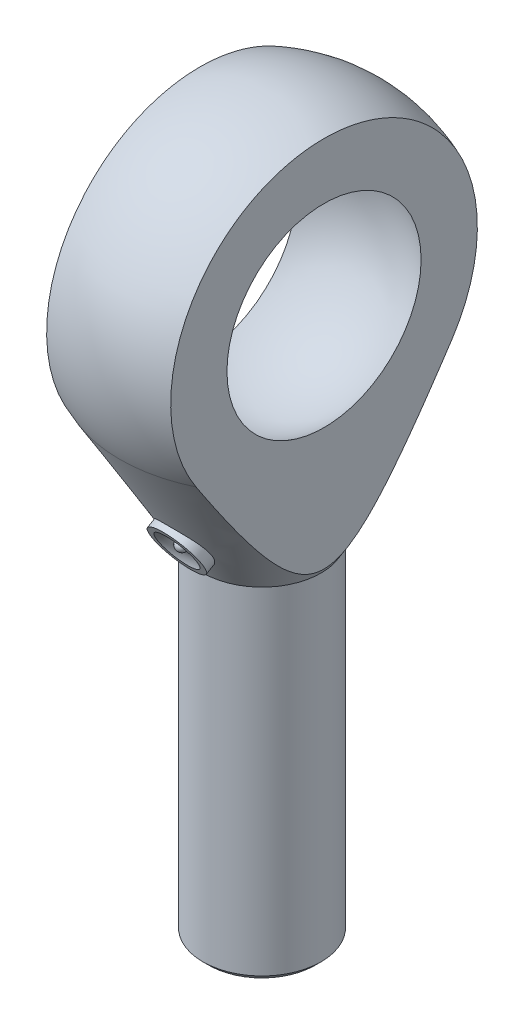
ISO-10303-21;
HEADER;
FILE_DESCRIPTION(('STEP AP214'),'2;1');
FILE_NAME('part.step','',(''),(''),'','','');
FILE_SCHEMA(('AUTOMOTIVE_DESIGN { 1 0 10303 214 1 1 1 1 }'));
ENDSEC;
DATA;
#1=APPLICATION_CONTEXT('core data for automotive mechanical design processes');
#2=APPLICATION_PROTOCOL_DEFINITION('international standard','automotive_design',2000,#1);
#3=PRODUCT_CONTEXT('',#1,'mechanical');
#4=PRODUCT('Part','Part','',(#3));
#5=PRODUCT_RELATED_PRODUCT_CATEGORY('part','',(#4));
#6=PRODUCT_DEFINITION_FORMATION('','',#4);
#7=PRODUCT_DEFINITION_CONTEXT('part definition',#1,'design');
#8=PRODUCT_DEFINITION('design','',#6,#7);
#9=PRODUCT_DEFINITION_SHAPE('','',#8);
#10=(LENGTH_UNIT() NAMED_UNIT(*) SI_UNIT(.MILLI.,.METRE.));
#11=(NAMED_UNIT(*) PLANE_ANGLE_UNIT() SI_UNIT($,.RADIAN.));
#12=(NAMED_UNIT(*) SI_UNIT($,.STERADIAN.) SOLID_ANGLE_UNIT());
#13=UNCERTAINTY_MEASURE_WITH_UNIT(LENGTH_MEASURE(1.E-05),#10,'distance_accuracy_value','');
#14=(GEOMETRIC_REPRESENTATION_CONTEXT(3) GLOBAL_UNCERTAINTY_ASSIGNED_CONTEXT((#13)) GLOBAL_UNIT_ASSIGNED_CONTEXT((#10,
#11,#12)) REPRESENTATION_CONTEXT('',''));
#15=CARTESIAN_POINT('',(0.,0.,0.));
#16=DIRECTION('',(0.,0.,1.));
#17=DIRECTION('',(1.,0.,0.));
#18=AXIS2_PLACEMENT_3D('',#15,#16,#17);
#19=CARTESIAN_POINT('',(0.,-19.,0.));
#20=DIRECTION('',(0.,1.,0.));
#21=DIRECTION('',(0.,0.,1.));
#22=AXIS2_PLACEMENT_3D('',#19,#20,#21);
#23=CONICAL_SURFACE('',#22,5.00000000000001,0.535846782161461);
#24=CARTESIAN_POINT('',(0.,-19.,0.));
#25=DIRECTION('',(0.,1.,0.));
#26=DIRECTION('',(0.,0.,1.));
#27=AXIS2_PLACEMENT_3D('',#24,#25,#26);
#28=CIRCLE('',#27,5.00000000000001);
#29=CARTESIAN_POINT('',(0.,-19.,5.00000000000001));
#30=VERTEX_POINT('',#29);
#31=EDGE_CURVE('E72',#30,#30,#28,.T.);
#32=ORIENTED_EDGE('',*,*,#31,.T.);
#33=EDGE_LOOP('',(#32));
#34=FACE_BOUND('',#33,.T.);
#35=CARTESIAN_POINT('',(0.,-7.14797043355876,0.));
#36=DIRECTION('',(0.,1.,0.));
#37=DIRECTION('',(0.,0.,1.));
#38=AXIS2_PLACEMENT_3D('',#35,#36,#37);
#39=CIRCLE('',#38,12.0377123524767);
#40=CARTESIAN_POINT('',(-5.25,-7.14797043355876,10.832544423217));
#41=VERTEX_POINT('',#40);
#42=CARTESIAN_POINT('',(5.25,-7.14797043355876,10.832544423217));
#43=VERTEX_POINT('',#42);
#44=EDGE_CURVE('E52',#41,#43,#39,.T.);
#45=ORIENTED_EDGE('',*,*,#44,.F.);
#46=CARTESIAN_POINT('',(-5.25,32.2330143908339,-35.03084662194));
#47=CARTESIAN_POINT('',(-5.25,30.5385005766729,-34.0133615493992));
#48=CARTESIAN_POINT('',(-5.25,28.8443748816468,-32.9952286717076));
#49=CARTESIAN_POINT('',(-5.25,25.4572376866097,-30.9570524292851));
#50=CARTESIAN_POINT('',(-5.25,23.7642262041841,-29.9370090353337));
#51=CARTESIAN_POINT('',(-5.25,20.3786557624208,-27.8937933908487));
#52=CARTESIAN_POINT('',(-5.25,18.6860977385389,-26.8706195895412));
#53=CARTESIAN_POINT('',(-5.25,15.3031192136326,-24.820793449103));
#54=CARTESIAN_POINT('',(-5.25,13.6126986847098,-23.7941411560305));
#55=CARTESIAN_POINT('',(-5.25,10.2741205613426,-21.7596857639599));
#56=CARTESIAN_POINT('',(-5.25,8.62589264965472,-20.7519982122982));
#57=CARTESIAN_POINT('',(-5.25,6.15690163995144,-19.2349364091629));
#58=CARTESIAN_POINT('',(-5.25,5.33444625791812,-18.7283169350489));
#59=CARTESIAN_POINT('',(-5.25,3.69098515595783,-17.7127347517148));
#60=CARTESIAN_POINT('',(-5.25,2.86997943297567,-17.2037720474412));
#61=CARTESIAN_POINT('',(-5.25,1.23011214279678,-16.1830028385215));
#62=CARTESIAN_POINT('',(-5.25,0.411249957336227,-15.6711973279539));
#63=CARTESIAN_POINT('',(-5.25,-1.22397392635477,-14.6436107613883));
#64=CARTESIAN_POINT('',(-5.25,-2.04033563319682,-14.1278297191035));
#65=CARTESIAN_POINT('',(-5.25,-3.66958599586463,-13.0909103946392));
#66=CARTESIAN_POINT('',(-5.25,-4.48247486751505,-12.5697724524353));
#67=CARTESIAN_POINT('',(-5.25,-5.69808971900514,-11.7823393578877));
#68=CARTESIAN_POINT('',(-5.25,-6.1026716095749,-11.5189094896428));
#69=CARTESIAN_POINT('',(-5.25,-6.91031133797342,-10.9897249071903));
#70=CARTESIAN_POINT('',(-5.25,-7.31336918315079,-10.7239702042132));
#71=CARTESIAN_POINT('',(-5.25,-7.96659191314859,-10.2899430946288));
#72=CARTESIAN_POINT('',(-5.25,-8.21733408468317,-10.1225394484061));
#73=CARTESIAN_POINT('',(-5.25,-8.71796428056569,-9.78645689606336));
#74=CARTESIAN_POINT('',(-5.25,-8.96785230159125,-9.61777798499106));
#75=CARTESIAN_POINT('',(-5.25,-9.46667439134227,-9.27892403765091));
#76=CARTESIAN_POINT('',(-5.25,-9.71560829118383,-9.10874875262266));
#77=CARTESIAN_POINT('',(-5.25,-10.2123031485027,-8.76669440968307));
#78=CARTESIAN_POINT('',(-5.25,-10.4600641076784,-8.59481535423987));
#79=CARTESIAN_POINT('',(-5.25,-10.9560877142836,-8.24773657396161));
#80=CARTESIAN_POINT('',(-5.25,-11.2043396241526,-8.07252148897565));
#81=CARTESIAN_POINT('',(-5.25,-11.699136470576,-7.71969734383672));
#82=CARTESIAN_POINT('',(-5.25,-11.945681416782,-7.54208829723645));
#83=CARTESIAN_POINT('',(-5.25,-12.4365851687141,-7.18408052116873));
#84=CARTESIAN_POINT('',(-5.25,-12.6809448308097,-7.00368296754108));
#85=CARTESIAN_POINT('',(-5.25,-13.1670740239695,-6.63943113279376));
#86=CARTESIAN_POINT('',(-5.25,-13.4088436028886,-6.45557691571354));
#87=CARTESIAN_POINT('',(-5.25,-13.829337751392,-6.1299057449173));
#88=CARTESIAN_POINT('',(-5.25,-14.0087783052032,-5.98901398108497));
#89=CARTESIAN_POINT('',(-5.25,-14.3654046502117,-5.70440754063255));
#90=CARTESIAN_POINT('',(-5.25,-14.5425904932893,-5.56069292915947));
#91=CARTESIAN_POINT('',(-5.25,-14.8944507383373,-5.26969127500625));
#92=CARTESIAN_POINT('',(-5.25,-15.0691210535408,-5.12239927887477));
#93=CARTESIAN_POINT('',(-5.25,-15.4149692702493,-4.82377699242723));
#94=CARTESIAN_POINT('',(-5.25,-15.5861473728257,-4.67244693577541));
#95=CARTESIAN_POINT('',(-5.25,-15.9226819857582,-4.36611694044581));
#96=CARTESIAN_POINT('',(-5.25,-16.0880743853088,-4.21115658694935));
#97=CARTESIAN_POINT('',(-5.25,-16.4131812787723,-3.89526310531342));
#98=CARTESIAN_POINT('',(-5.25,-16.5728941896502,-3.73432833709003));
#99=CARTESIAN_POINT('',(-5.25,-16.884228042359,-3.40554762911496));
#100=CARTESIAN_POINT('',(-5.25,-17.0358685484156,-3.23772032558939));
#101=CARTESIAN_POINT('',(-5.25,-17.3285170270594,-2.8930972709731));
#102=CARTESIAN_POINT('',(-5.25,-17.4695329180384,-2.71630836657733));
#103=CARTESIAN_POINT('',(-5.25,-17.6711692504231,-2.44083492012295));
#104=CARTESIAN_POINT('',(-5.25,-17.7373779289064,-2.34623998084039));
#105=CARTESIAN_POINT('',(-5.25,-17.8650205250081,-2.15384005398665));
#106=CARTESIAN_POINT('',(-5.25,-17.9264536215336,-2.05603451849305));
#107=CARTESIAN_POINT('',(-5.25,-18.0434932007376,-1.85701072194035));
#108=CARTESIAN_POINT('',(-5.25,-18.0991018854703,-1.7557937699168));
#109=CARTESIAN_POINT('',(-5.25,-18.2032664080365,-1.54983393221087));
#110=CARTESIAN_POINT('',(-5.25,-18.2518234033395,-1.44509162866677));
#111=CARTESIAN_POINT('',(-5.25,-18.37139715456,-1.15759778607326));
#112=CARTESIAN_POINT('',(-5.25,-18.4344924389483,-0.971338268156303));
#113=CARTESIAN_POINT('',(-5.25,-18.5051835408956,-0.686233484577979));
#114=CARTESIAN_POINT('',(-5.25,-18.5247528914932,-0.590276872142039));
#115=CARTESIAN_POINT('',(-5.25,-18.5552209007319,-0.396966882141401));
#116=CARTESIAN_POINT('',(-5.25,-18.5661199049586,-0.299613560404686));
#117=CARTESIAN_POINT('',(-5.25,-18.5788049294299,-0.103675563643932));
#118=CARTESIAN_POINT('',(-5.25,-18.5805312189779,-0.0050869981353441));
#119=CARTESIAN_POINT('',(-5.25,-18.5746360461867,0.191805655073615));
#120=CARTESIAN_POINT('',(-5.25,-18.567014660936,0.290109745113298));
#121=CARTESIAN_POINT('',(-5.25,-18.5427594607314,0.48559733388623));
#122=CARTESIAN_POINT('',(-5.25,-18.526125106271,0.582780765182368));
#123=CARTESIAN_POINT('',(-5.25,-18.4845270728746,0.775372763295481));
#124=CARTESIAN_POINT('',(-5.25,-18.4595580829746,0.870780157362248));
#125=CARTESIAN_POINT('',(-5.25,-18.3554460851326,1.21265175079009));
#126=CARTESIAN_POINT('',(-5.25,-18.25421840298,1.45256343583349));
#127=CARTESIAN_POINT('',(-5.25,-18.0764006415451,1.79856493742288));
#128=CARTESIAN_POINT('',(-5.25,-18.012612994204,1.91184438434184));
#129=CARTESIAN_POINT('',(-5.25,-17.8779793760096,2.1341605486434));
#130=CARTESIAN_POINT('',(-5.25,-17.8071346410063,2.24319800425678));
#131=CARTESIAN_POINT('',(-5.25,-17.6254032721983,2.50732493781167));
#132=CARTESIAN_POINT('',(-5.25,-17.5112609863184,2.6601548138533));
#133=CARTESIAN_POINT('',(-5.25,-17.2740055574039,2.95873829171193));
#134=CARTESIAN_POINT('',(-5.25,-17.1508873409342,3.10448781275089));
#135=CARTESIAN_POINT('',(-5.25,-16.8976788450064,3.39031411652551));
#136=CARTESIAN_POINT('',(-5.25,-16.7675742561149,3.53037813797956));
#137=CARTESIAN_POINT('',(-5.25,-16.5022366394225,3.80547716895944));
#138=CARTESIAN_POINT('',(-5.25,-16.3670046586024,3.94051319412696));
#139=CARTESIAN_POINT('',(-5.25,-16.0907919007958,4.20806622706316));
#140=CARTESIAN_POINT('',(-5.25,-15.9497603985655,4.34053065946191));
#141=CARTESIAN_POINT('',(-5.25,-15.6644041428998,4.60186373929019));
#142=CARTESIAN_POINT('',(-5.25,-15.5200792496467,4.73073223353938));
#143=CARTESIAN_POINT('',(-5.25,-15.2289688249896,4.98524577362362));
#144=CARTESIAN_POINT('',(-5.25,-15.0821869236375,5.11089498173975));
#145=CARTESIAN_POINT('',(-5.25,-14.7864498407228,5.35959144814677));
#146=CARTESIAN_POINT('',(-5.25,-14.6374947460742,5.48263881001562));
#147=CARTESIAN_POINT('',(-5.25,-14.304653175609,5.75344976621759));
#148=CARTESIAN_POINT('',(-5.25,-14.1203218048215,5.90066606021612));
#149=CARTESIAN_POINT('',(-5.25,-13.7494600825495,6.19230557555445));
#150=CARTESIAN_POINT('',(-5.25,-13.5629296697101,6.33672871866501));
#151=CARTESIAN_POINT('',(-5.25,-13.0005975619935,6.76649499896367));
#152=CARTESIAN_POINT('',(-5.25,-12.6220942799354,7.04830337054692));
#153=CARTESIAN_POINT('',(-5.25,-11.8598781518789,7.6050908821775));
#154=CARTESIAN_POINT('',(-5.25,-11.4761631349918,7.88006703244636));
#155=CARTESIAN_POINT('',(-5.25,-10.7049874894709,8.42472662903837));
#156=CARTESIAN_POINT('',(-5.25,-10.3175267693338,8.69440994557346));
#157=CARTESIAN_POINT('',(-5.25,-9.53888177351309,9.23025715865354));
#158=CARTESIAN_POINT('',(-5.25,-9.14769101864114,9.49641162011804));
#159=CARTESIAN_POINT('',(-5.25,-8.36308257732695,10.0254246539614));
#160=CARTESIAN_POINT('',(-5.25,-7.96966486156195,10.288283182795));
#161=CARTESIAN_POINT('',(-5.25,-7.18116877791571,10.8112612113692));
#162=CARTESIAN_POINT('',(-5.25,-6.7860908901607,11.0713814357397));
#163=CARTESIAN_POINT('',(-5.25,-5.99450123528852,11.5894307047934));
#164=CARTESIAN_POINT('',(-5.25,-5.59798946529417,11.8473597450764));
#165=CARTESIAN_POINT('',(-5.25,-4.49651209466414,12.5602941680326));
#166=CARTESIAN_POINT('',(-5.25,-3.79028786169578,13.0133546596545));
#167=CARTESIAN_POINT('',(-5.25,-2.37510371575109,13.9152999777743));
#168=CARTESIAN_POINT('',(-5.25,-1.6661435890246,14.3641844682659));
#169=CARTESIAN_POINT('',(-5.25,-0.24904109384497,15.256960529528));
#170=CARTESIAN_POINT('',(-5.25,0.459093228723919,15.7008648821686));
#171=CARTESIAN_POINT('',(-5.25,1.87686953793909,16.5861096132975));
#172=CARTESIAN_POINT('',(-5.25,2.58651137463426,17.0274502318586));
#173=CARTESIAN_POINT('',(-5.25,3.29672719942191,17.4678594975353));
#174=B_SPLINE_CURVE_WITH_KNOTS('',3,(#46,#47,#48,#49,#50,#51,#52,#53,#54,#55,#56,#57,#58,#59,
#60,#61,#62,#63,#64,#65,#66,#67,#68,#69,#70,#71,#72,#73,#74,#75,#76,#77,#78,#79,#80,#81,#82,#83,
#84,#85,#86,#87,#88,#89,#90,#91,#92,#93,#94,#95,#96,#97,#98,#99,#100,#101,#102,#103,#104,#105,
#106,#107,#108,#109,#110,#111,#112,#113,#114,#115,#116,#117,#118,#119,#120,#121,#122,#123,#124,
#125,#126,#127,#128,#129,#130,#131,#132,#133,#134,#135,#136,#137,#138,#139,#140,#141,#142,#143,
#144,#145,#146,#147,#148,#149,#150,#151,#152,#153,#154,#155,#156,#157,#158,#159,#160,#161,#162,
#163,#164,#165,#166,#167,#168,#169,#170,#171,#172,#173),.UNSPECIFIED.,.F.,.F.,(4,2,2,2,2,2,2,2,
2,2,2,2,2,2,2,2,2,2,2,2,2,2,2,2,2,2,2,2,2,2,2,2,2,2,2,2,2,2,2,2,2,2,2,2,2,2,2,2,2,2,2,2,2,2,2,2,
2,2,2,2,2,2,2,4),(0.,5.92957736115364,11.8592461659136,17.792600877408,23.7258773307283,
29.5214475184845,32.4193516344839,35.3172496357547,38.2141911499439,41.1111226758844,
44.0078714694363,45.4562220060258,46.9045655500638,47.8090293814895,48.7134967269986,
49.6181173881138,50.5227367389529,51.4342972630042,52.3458526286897,53.2570335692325,
54.1681976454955,54.8526047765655,55.5369961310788,56.2223962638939,56.9077568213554,
57.5875737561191,58.2675787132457,58.9458526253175,59.6236159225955,59.9698908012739,
60.3162250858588,60.662427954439,61.0085739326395,61.5958803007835,61.8893499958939,
62.1828079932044,62.4781746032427,62.7735387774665,63.0689206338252,63.3644910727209,
64.140520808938,64.5304231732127,64.9202573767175,65.4920464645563,66.0641612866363,
66.6374962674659,67.2107148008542,67.7910974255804,68.371504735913,68.951119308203,
69.5307107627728,70.2383886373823,70.9460863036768,72.3616328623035,73.7777883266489,
75.1939784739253,76.6134001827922,78.032840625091,79.451895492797,80.8709532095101,
83.3881010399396,85.9054496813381,88.4127426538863,90.9197969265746),.UNSPECIFIED.);
#175=CARTESIAN_POINT('',(-5.25,-7.14797043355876,-10.832544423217));
#176=VERTEX_POINT('',#175);
#177=EDGE_CURVE('E58',#41,#176,#174,.F.);
#178=ORIENTED_EDGE('',*,*,#177,.T.);
#179=CARTESIAN_POINT('',(5.25,-7.14797043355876,-10.832544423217));
#180=VERTEX_POINT('',#179);
#181=EDGE_CURVE('E66',#180,#176,#39,.T.);
#182=ORIENTED_EDGE('',*,*,#181,.F.);
#183=CARTESIAN_POINT('',(5.25,32.2330143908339,-35.03084662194));
#184=CARTESIAN_POINT('',(5.25,30.5385005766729,-34.0133615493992));
#185=CARTESIAN_POINT('',(5.25,28.8443748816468,-32.9952286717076));
#186=CARTESIAN_POINT('',(5.25,25.4572376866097,-30.9570524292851));
#187=CARTESIAN_POINT('',(5.25,23.7642262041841,-29.9370090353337));
#188=CARTESIAN_POINT('',(5.25,20.3786557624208,-27.8937933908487));
#189=CARTESIAN_POINT('',(5.25,18.6860977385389,-26.8706195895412));
#190=CARTESIAN_POINT('',(5.25,15.3031192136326,-24.820793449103));
#191=CARTESIAN_POINT('',(5.25,13.6126986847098,-23.7941411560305));
#192=CARTESIAN_POINT('',(5.25,10.2741205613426,-21.7596857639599));
#193=CARTESIAN_POINT('',(5.25,8.62589264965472,-20.7519982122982));
#194=CARTESIAN_POINT('',(5.25,6.15690163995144,-19.2349364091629));
#195=CARTESIAN_POINT('',(5.25,5.33444625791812,-18.7283169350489));
#196=CARTESIAN_POINT('',(5.25,3.69098515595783,-17.7127347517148));
#197=CARTESIAN_POINT('',(5.25,2.86997943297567,-17.2037720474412));
#198=CARTESIAN_POINT('',(5.25,1.23011214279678,-16.1830028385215));
#199=CARTESIAN_POINT('',(5.25,0.411249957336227,-15.6711973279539));
#200=CARTESIAN_POINT('',(5.25,-1.22397392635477,-14.6436107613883));
#201=CARTESIAN_POINT('',(5.25,-2.04033563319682,-14.1278297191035));
#202=CARTESIAN_POINT('',(5.25,-3.66958599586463,-13.0909103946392));
#203=CARTESIAN_POINT('',(5.25,-4.48247486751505,-12.5697724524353));
#204=CARTESIAN_POINT('',(5.25,-5.69808971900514,-11.7823393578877));
#205=CARTESIAN_POINT('',(5.25,-6.1026716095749,-11.5189094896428));
#206=CARTESIAN_POINT('',(5.25,-6.91031133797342,-10.9897249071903));
#207=CARTESIAN_POINT('',(5.25,-7.31336918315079,-10.7239702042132));
#208=CARTESIAN_POINT('',(5.25,-7.96659191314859,-10.2899430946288));
#209=CARTESIAN_POINT('',(5.25,-8.21733408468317,-10.1225394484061));
#210=CARTESIAN_POINT('',(5.25,-8.71796428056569,-9.78645689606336));
#211=CARTESIAN_POINT('',(5.25,-8.96785230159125,-9.61777798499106));
#212=CARTESIAN_POINT('',(5.25,-9.46667439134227,-9.27892403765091));
#213=CARTESIAN_POINT('',(5.25,-9.71560829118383,-9.10874875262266));
#214=CARTESIAN_POINT('',(5.25,-10.2123031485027,-8.76669440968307));
#215=CARTESIAN_POINT('',(5.25,-10.4600641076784,-8.59481535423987));
#216=CARTESIAN_POINT('',(5.25,-10.9560877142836,-8.24773657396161));
#217=CARTESIAN_POINT('',(5.25,-11.2043396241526,-8.07252148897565));
#218=CARTESIAN_POINT('',(5.25,-11.699136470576,-7.71969734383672));
#219=CARTESIAN_POINT('',(5.25,-11.945681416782,-7.54208829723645));
#220=CARTESIAN_POINT('',(5.25,-12.4365851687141,-7.18408052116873));
#221=CARTESIAN_POINT('',(5.25,-12.6809448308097,-7.00368296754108));
#222=CARTESIAN_POINT('',(5.25,-13.1670740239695,-6.63943113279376));
#223=CARTESIAN_POINT('',(5.25,-13.4088436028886,-6.45557691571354));
#224=CARTESIAN_POINT('',(5.25,-13.829337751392,-6.1299057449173));
#225=CARTESIAN_POINT('',(5.25,-14.0087783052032,-5.98901398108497));
#226=CARTESIAN_POINT('',(5.25,-14.3654046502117,-5.70440754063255));
#227=CARTESIAN_POINT('',(5.25,-14.5425904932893,-5.56069292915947));
#228=CARTESIAN_POINT('',(5.25,-14.8944507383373,-5.26969127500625));
#229=CARTESIAN_POINT('',(5.25,-15.0691210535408,-5.12239927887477));
#230=CARTESIAN_POINT('',(5.25,-15.4149692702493,-4.82377699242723));
#231=CARTESIAN_POINT('',(5.25,-15.5861473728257,-4.67244693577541));
#232=CARTESIAN_POINT('',(5.25,-15.9226819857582,-4.36611694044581));
#233=CARTESIAN_POINT('',(5.25,-16.0880743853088,-4.21115658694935));
#234=CARTESIAN_POINT('',(5.25,-16.4131812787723,-3.89526310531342));
#235=CARTESIAN_POINT('',(5.25,-16.5728941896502,-3.73432833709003));
#236=CARTESIAN_POINT('',(5.25,-16.884228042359,-3.40554762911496));
#237=CARTESIAN_POINT('',(5.25,-17.0358685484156,-3.23772032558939));
#238=CARTESIAN_POINT('',(5.25,-17.3285170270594,-2.8930972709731));
#239=CARTESIAN_POINT('',(5.25,-17.4695329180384,-2.71630836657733));
#240=CARTESIAN_POINT('',(5.25,-17.6711692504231,-2.44083492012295));
#241=CARTESIAN_POINT('',(5.25,-17.7373779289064,-2.34623998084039));
#242=CARTESIAN_POINT('',(5.25,-17.8650205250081,-2.15384005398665));
#243=CARTESIAN_POINT('',(5.25,-17.9264536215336,-2.05603451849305));
#244=CARTESIAN_POINT('',(5.25,-18.0434932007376,-1.85701072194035));
#245=CARTESIAN_POINT('',(5.25,-18.0991018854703,-1.7557937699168));
#246=CARTESIAN_POINT('',(5.25,-18.2032664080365,-1.54983393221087));
#247=CARTESIAN_POINT('',(5.25,-18.2518234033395,-1.44509162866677));
#248=CARTESIAN_POINT('',(5.25,-18.37139715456,-1.15759778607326));
#249=CARTESIAN_POINT('',(5.25,-18.4344924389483,-0.971338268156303));
#250=CARTESIAN_POINT('',(5.25,-18.5051835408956,-0.686233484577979));
#251=CARTESIAN_POINT('',(5.25,-18.5247528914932,-0.590276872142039));
#252=CARTESIAN_POINT('',(5.25,-18.5552209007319,-0.396966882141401));
#253=CARTESIAN_POINT('',(5.25,-18.5661199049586,-0.299613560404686));
#254=CARTESIAN_POINT('',(5.25,-18.5788049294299,-0.103675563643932));
#255=CARTESIAN_POINT('',(5.25,-18.5805312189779,-0.0050869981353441));
#256=CARTESIAN_POINT('',(5.25,-18.5746360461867,0.191805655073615));
#257=CARTESIAN_POINT('',(5.25,-18.567014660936,0.290109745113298));
#258=CARTESIAN_POINT('',(5.25,-18.5427594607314,0.48559733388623));
#259=CARTESIAN_POINT('',(5.25,-18.526125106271,0.582780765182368));
#260=CARTESIAN_POINT('',(5.25,-18.4845270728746,0.775372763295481));
#261=CARTESIAN_POINT('',(5.25,-18.4595580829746,0.870780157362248));
#262=CARTESIAN_POINT('',(5.25,-18.3554460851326,1.21265175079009));
#263=CARTESIAN_POINT('',(5.25,-18.25421840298,1.45256343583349));
#264=CARTESIAN_POINT('',(5.25,-18.0764006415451,1.79856493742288));
#265=CARTESIAN_POINT('',(5.25,-18.012612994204,1.91184438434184));
#266=CARTESIAN_POINT('',(5.25,-17.8779793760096,2.1341605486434));
#267=CARTESIAN_POINT('',(5.25,-17.8071346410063,2.24319800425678));
#268=CARTESIAN_POINT('',(5.25,-17.6254032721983,2.50732493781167));
#269=CARTESIAN_POINT('',(5.25,-17.5112609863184,2.6601548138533));
#270=CARTESIAN_POINT('',(5.25,-17.2740055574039,2.95873829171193));
#271=CARTESIAN_POINT('',(5.25,-17.1508873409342,3.10448781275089));
#272=CARTESIAN_POINT('',(5.25,-16.8976788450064,3.39031411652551));
#273=CARTESIAN_POINT('',(5.25,-16.7675742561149,3.53037813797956));
#274=CARTESIAN_POINT('',(5.25,-16.5022366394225,3.80547716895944));
#275=CARTESIAN_POINT('',(5.25,-16.3670046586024,3.94051319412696));
#276=CARTESIAN_POINT('',(5.25,-16.0907919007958,4.20806622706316));
#277=CARTESIAN_POINT('',(5.25,-15.9497603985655,4.34053065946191));
#278=CARTESIAN_POINT('',(5.25,-15.6644041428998,4.60186373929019));
#279=CARTESIAN_POINT('',(5.25,-15.5200792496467,4.73073223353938));
#280=CARTESIAN_POINT('',(5.25,-15.2289688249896,4.98524577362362));
#281=CARTESIAN_POINT('',(5.25,-15.0821869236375,5.11089498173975));
#282=CARTESIAN_POINT('',(5.25,-14.7864498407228,5.35959144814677));
#283=CARTESIAN_POINT('',(5.25,-14.6374947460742,5.48263881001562));
#284=CARTESIAN_POINT('',(5.25,-14.304653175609,5.75344976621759));
#285=CARTESIAN_POINT('',(5.25,-14.1203218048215,5.90066606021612));
#286=CARTESIAN_POINT('',(5.25,-13.7494600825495,6.19230557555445));
#287=CARTESIAN_POINT('',(5.25,-13.5629296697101,6.33672871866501));
#288=CARTESIAN_POINT('',(5.25,-13.0005975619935,6.76649499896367));
#289=CARTESIAN_POINT('',(5.25,-12.6220942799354,7.04830337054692));
#290=CARTESIAN_POINT('',(5.25,-11.8598781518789,7.6050908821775));
#291=CARTESIAN_POINT('',(5.25,-11.4761631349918,7.88006703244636));
#292=CARTESIAN_POINT('',(5.25,-10.7049874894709,8.42472662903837));
#293=CARTESIAN_POINT('',(5.25,-10.3175267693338,8.69440994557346));
#294=CARTESIAN_POINT('',(5.25,-9.53888177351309,9.23025715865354));
#295=CARTESIAN_POINT('',(5.25,-9.14769101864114,9.49641162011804));
#296=CARTESIAN_POINT('',(5.25,-8.36308257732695,10.0254246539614));
#297=CARTESIAN_POINT('',(5.25,-7.96966486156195,10.288283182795));
#298=CARTESIAN_POINT('',(5.25,-7.18116877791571,10.8112612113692));
#299=CARTESIAN_POINT('',(5.25,-6.7860908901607,11.0713814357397));
#300=CARTESIAN_POINT('',(5.25,-5.99450123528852,11.5894307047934));
#301=CARTESIAN_POINT('',(5.25,-5.59798946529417,11.8473597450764));
#302=CARTESIAN_POINT('',(5.25,-4.49651209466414,12.5602941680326));
#303=CARTESIAN_POINT('',(5.25,-3.79028786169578,13.0133546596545));
#304=CARTESIAN_POINT('',(5.25,-2.37510371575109,13.9152999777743));
#305=CARTESIAN_POINT('',(5.25,-1.6661435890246,14.3641844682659));
#306=CARTESIAN_POINT('',(5.25,-0.24904109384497,15.256960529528));
#307=CARTESIAN_POINT('',(5.25,0.459093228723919,15.7008648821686));
#308=CARTESIAN_POINT('',(5.25,1.87686953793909,16.5861096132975));
#309=CARTESIAN_POINT('',(5.25,2.58651137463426,17.0274502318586));
#310=CARTESIAN_POINT('',(5.25,3.29672719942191,17.4678594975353));
#311=B_SPLINE_CURVE_WITH_KNOTS('',3,(#183,#184,#185,#186,#187,#188,#189,#190,#191,#192,#193,
#194,#195,#196,#197,#198,#199,#200,#201,#202,#203,#204,#205,#206,#207,#208,#209,#210,#211,#212,
#213,#214,#215,#216,#217,#218,#219,#220,#221,#222,#223,#224,#225,#226,#227,#228,#229,#230,#231,
#232,#233,#234,#235,#236,#237,#238,#239,#240,#241,#242,#243,#244,#245,#246,#247,#248,#249,#250,
#251,#252,#253,#254,#255,#256,#257,#258,#259,#260,#261,#262,#263,#264,#265,#266,#267,#268,#269,
#270,#271,#272,#273,#274,#275,#276,#277,#278,#279,#280,#281,#282,#283,#284,#285,#286,#287,#288,
#289,#290,#291,#292,#293,#294,#295,#296,#297,#298,#299,#300,#301,#302,#303,#304,#305,#306,#307,
#308,#309,#310),.UNSPECIFIED.,.F.,.F.,(4,2,2,2,2,2,2,2,2,2,2,2,2,2,2,2,2,2,2,2,2,2,2,2,2,2,2,2,
2,2,2,2,2,2,2,2,2,2,2,2,2,2,2,2,2,2,2,2,2,2,2,2,2,2,2,2,2,2,2,2,2,2,2,4),(0.,5.92957736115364,
11.8592461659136,17.792600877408,23.7258773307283,29.5214475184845,32.4193516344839,
35.3172496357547,38.2141911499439,41.1111226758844,44.0078714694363,45.4562220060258,
46.9045655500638,47.8090293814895,48.7134967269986,49.6181173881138,50.5227367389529,
51.4342972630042,52.3458526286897,53.2570335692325,54.1681976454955,54.8526047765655,
55.5369961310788,56.2223962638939,56.9077568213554,57.5875737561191,58.2675787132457,
58.9458526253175,59.6236159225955,59.9698908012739,60.3162250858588,60.662427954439,
61.0085739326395,61.5958803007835,61.8893499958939,62.1828079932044,62.4781746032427,
62.7735387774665,63.0689206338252,63.3644910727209,64.140520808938,64.5304231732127,
64.9202573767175,65.4920464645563,66.0641612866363,66.6374962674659,67.2107148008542,
67.7910974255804,68.371504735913,68.951119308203,69.5307107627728,70.2383886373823,
70.9460863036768,72.3616328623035,73.7777883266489,75.1939784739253,76.6134001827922,
78.032840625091,79.451895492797,80.8709532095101,83.3881010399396,85.9054496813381,
88.4127426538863,90.9197969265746),.UNSPECIFIED.);
#312=EDGE_CURVE('E64',#180,#43,#311,.T.);
#313=ORIENTED_EDGE('',*,*,#312,.T.);
#314=EDGE_LOOP('',(#45,#178,#182,#313));
#315=FACE_BOUND('',#314,.T.);
#316=CARTESIAN_POINT('',(-1.43916240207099,-17.4291283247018,5.7555796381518));
#317=CARTESIAN_POINT('',(-1.34343339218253,-17.5074973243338,5.73154654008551));
#318=CARTESIAN_POINT('',(-1.24104886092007,-17.5789685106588,5.71142590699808));
#319=CARTESIAN_POINT('',(-1.02543986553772,-17.7052413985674,5.67787723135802));
#320=CARTESIAN_POINT('',(-0.912214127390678,-17.7600411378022,5.66444997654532));
#321=CARTESIAN_POINT('',(-0.677557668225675,-17.850495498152,5.6432005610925));
#322=CARTESIAN_POINT('',(-0.556110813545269,-17.8861111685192,5.63538979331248));
#323=CARTESIAN_POINT('',(-0.308723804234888,-17.9360624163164,5.62463604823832));
#324=CARTESIAN_POINT('',(-0.18278543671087,-17.9504063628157,5.62169115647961));
#325=CARTESIAN_POINT('',(0.0650532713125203,-17.9568618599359,5.6203533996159));
#326=CARTESIAN_POINT('',(0.186932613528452,-17.9497682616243,5.62179780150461));
#327=CARTESIAN_POINT('',(0.427686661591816,-17.9154683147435,5.62904518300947));
#328=CARTESIAN_POINT('',(0.546561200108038,-17.8882608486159,5.63484840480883));
#329=CARTESIAN_POINT('',(0.777025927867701,-17.8154885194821,5.65131387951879));
#330=CARTESIAN_POINT('',(0.888670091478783,-17.7700839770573,5.66193380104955));
#331=CARTESIAN_POINT('',(1.10310845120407,-17.6629865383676,5.6888756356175));
#332=CARTESIAN_POINT('',(1.20590026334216,-17.6012892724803,5.70519907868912));
#333=CARTESIAN_POINT('',(1.40501460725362,-17.4606979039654,5.74549754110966));
#334=CARTESIAN_POINT('',(1.50078691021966,-17.3811185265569,5.76980329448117));
#335=CARTESIAN_POINT('',(1.67772546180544,-17.2096728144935,5.82686909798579));
#336=CARTESIAN_POINT('',(1.75888967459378,-17.1178047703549,5.85963032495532));
#337=CARTESIAN_POINT('',(1.90604305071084,-16.9227745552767,5.93519279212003));
#338=CARTESIAN_POINT('',(1.97165516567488,-16.8194068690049,5.97820084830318));
#339=CARTESIAN_POINT('',(2.083184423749,-16.606719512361,6.0739295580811));
#340=CARTESIAN_POINT('',(2.12910743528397,-16.4974016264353,6.12664731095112));
#341=CARTESIAN_POINT('',(2.19836741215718,-16.2804832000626,6.23887208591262));
#342=CARTESIAN_POINT('',(2.22245390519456,-16.1729612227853,6.29806859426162));
#343=CARTESIAN_POINT('',(2.24998896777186,-15.9590907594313,6.42300279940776));
#344=CARTESIAN_POINT('',(2.25343979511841,-15.8527421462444,6.48873977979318));
#345=CARTESIAN_POINT('',(2.23983642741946,-15.6467806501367,6.62267747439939));
#346=CARTESIAN_POINT('',(2.22329555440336,-15.5470656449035,6.69077470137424));
#347=CARTESIAN_POINT('',(2.17116807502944,-15.3537942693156,6.82839209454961));
#348=CARTESIAN_POINT('',(2.13557933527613,-15.2602385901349,6.89791241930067));
#349=CARTESIAN_POINT('',(2.0454412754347,-15.0791211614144,7.03725124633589));
#350=CARTESIAN_POINT('',(1.99048586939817,-14.9917401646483,7.10704167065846));
#351=CARTESIAN_POINT('',(1.86333807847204,-14.826906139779,7.24253487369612));
#352=CARTESIAN_POINT('',(1.79114255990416,-14.7494549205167,7.30823690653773));
#353=CARTESIAN_POINT('',(1.62883147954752,-14.60353093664,7.43487361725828));
#354=CARTESIAN_POINT('',(1.53822164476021,-14.5354193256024,7.4955919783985));
#355=CARTESIAN_POINT('',(1.34301210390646,-14.4124393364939,7.60717427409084));
#356=CARTESIAN_POINT('',(1.23841204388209,-14.3575712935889,7.65803795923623));
#357=CARTESIAN_POINT('',(1.01791095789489,-14.2621354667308,7.74760739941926));
#358=CARTESIAN_POINT('',(0.901998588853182,-14.2215822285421,7.78630078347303));
#359=CARTESIAN_POINT('',(0.662245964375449,-14.1557749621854,7.84955561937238));
#360=CARTESIAN_POINT('',(0.538407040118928,-14.1305183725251,7.87411943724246));
#361=CARTESIAN_POINT('',(0.289595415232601,-14.0963464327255,7.90744349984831));
#362=CARTESIAN_POINT('',(0.164726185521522,-14.0870430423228,7.91657893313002));
#363=CARTESIAN_POINT('',(-0.0853957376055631,-14.0838025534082,7.91975534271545));
#364=CARTESIAN_POINT('',(-0.210648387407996,-14.0898637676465,7.91379797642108));
#365=CARTESIAN_POINT('',(-0.455833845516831,-14.1169724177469,7.88731429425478));
#366=CARTESIAN_POINT('',(-0.575820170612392,-14.1377729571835,7.86702801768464));
#367=CARTESIAN_POINT('',(-0.809302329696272,-14.1936080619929,7.81312008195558));
#368=CARTESIAN_POINT('',(-0.922797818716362,-14.2286433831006,7.77949771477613));
#369=CARTESIAN_POINT('',(-1.14157478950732,-14.3126921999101,7.69999152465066));
#370=CARTESIAN_POINT('',(-1.24674498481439,-14.3618640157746,7.65396921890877));
#371=CARTESIAN_POINT('',(-1.44469581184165,-14.4730527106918,7.55188358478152));
#372=CARTESIAN_POINT('',(-1.53747442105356,-14.5350716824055,7.49581862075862));
#373=CARTESIAN_POINT('',(-1.7105336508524,-14.6726063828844,7.37445865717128));
#374=CARTESIAN_POINT('',(-1.79042926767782,-14.7484295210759,7.30896254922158));
#375=CARTESIAN_POINT('',(-1.93261087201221,-14.9110732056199,7.17269338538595));
#376=CARTESIAN_POINT('',(-1.99489521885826,-14.9978947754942,7.10191983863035));
#377=CARTESIAN_POINT('',(-2.10043087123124,-15.1815711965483,6.95758626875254));
#378=CARTESIAN_POINT('',(-2.14354516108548,-15.2784923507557,6.88401014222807));
#379=CARTESIAN_POINT('',(-2.2086591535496,-15.4797941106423,6.73772333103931));
#380=CARTESIAN_POINT('',(-2.23066368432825,-15.5841730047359,6.66501245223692));
#381=CARTESIAN_POINT('',(-2.25241670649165,-15.7948807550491,6.52546993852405));
#382=CARTESIAN_POINT('',(-2.25275927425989,-15.9010775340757,6.45853173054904));
#383=CARTESIAN_POINT('',(-2.23259086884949,-16.1152008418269,6.33086858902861));
#384=CARTESIAN_POINT('',(-2.21208357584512,-16.2231270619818,6.27014256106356));
#385=CARTESIAN_POINT('',(-2.15177280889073,-16.4344691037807,6.15831210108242));
#386=CARTESIAN_POINT('',(-2.11252217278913,-16.5379268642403,6.10698695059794));
#387=CARTESIAN_POINT('',(-2.01624797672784,-16.7403115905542,6.0128256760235));
#388=CARTESIAN_POINT('',(-1.9592252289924,-16.8392387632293,5.96998916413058));
#389=CARTESIAN_POINT('',(-1.83193668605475,-17.0253923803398,5.89459776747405));
#390=CARTESIAN_POINT('',(-1.76235506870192,-17.1129406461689,5.86167661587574));
#391=CARTESIAN_POINT('',(-1.61012625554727,-17.2786601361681,5.80325261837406));
#392=CARTESIAN_POINT('',(-1.52747653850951,-17.3568295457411,5.77775120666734));
#393=CARTESIAN_POINT('',(-1.43916240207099,-17.4291283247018,5.7555796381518));
#394=B_SPLINE_CURVE_WITH_KNOTS('',3,(#316,#317,#318,#319,#320,#321,#322,#323,#324,#325,#326,
#327,#328,#329,#330,#331,#332,#333,#334,#335,#336,#337,#338,#339,#340,#341,#342,#343,#344,#345,
#346,#347,#348,#349,#350,#351,#352,#353,#354,#355,#356,#357,#358,#359,#360,#361,#362,#363,#364,
#365,#366,#367,#368,#369,#370,#371,#372,#373,#374,#375,#376,#377,#378,#379,#380,#381,#382,#383,
#384,#385,#386,#387,#388,#389,#390,#391,#392,#393),.UNSPECIFIED.,.T.,.F.,(4,2,2,2,2,2,2,2,2,2,2,
2,2,2,2,2,2,2,2,2,2,2,2,2,2,2,2,2,2,2,2,2,2,2,2,2,2,2,4),(0.,0.377692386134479,
0.755429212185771,1.1339301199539,1.51228207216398,1.87677991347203,2.2412980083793,
2.60267283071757,2.96414467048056,3.34303061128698,3.72196931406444,4.10932371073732,
4.49656257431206,4.86994221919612,5.24328101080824,5.60723394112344,5.97122764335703,
6.34335858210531,6.71555721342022,7.09951986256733,7.48349222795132,7.86785364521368,
8.25215068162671,8.62696015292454,9.0017284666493,9.37036311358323,9.73901733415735,
10.1119728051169,10.4849890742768,10.8676463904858,11.2503393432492,11.6357252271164,
12.0210229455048,12.3957492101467,12.7704093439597,13.1346437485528,13.4988615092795,
13.8472317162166,14.1956692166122),.UNSPECIFIED.);
#395=CARTESIAN_POINT('',(-1.43916240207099,-17.4291283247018,5.7555796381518));
#396=VERTEX_POINT('',#395);
#397=EDGE_CURVE('E11',#396,#396,#394,.T.);
#398=ORIENTED_EDGE('',*,*,#397,.F.);
#399=EDGE_LOOP('',(#398));
#400=FACE_BOUND('',#399,.T.);
#401=ADVANCED_FACE('F28',(#34,#315,#400),#23,.T.);
#402=CARTESIAN_POINT('',(0.,0.,0.));
#403=DIRECTION('',(0.,1.,0.));
#404=DIRECTION('',(1.,0.,0.));
#405=AXIS2_PLACEMENT_3D('',#402,#403,#404);
#406=SPHERICAL_SURFACE('',#405,14.);
#407=CARTESIAN_POINT('',(-5.25,0.,0.));
#408=DIRECTION('',(1.,0.,0.));
#409=DIRECTION('',(0.,0.,-1.));
#410=AXIS2_PLACEMENT_3D('',#407,#408,#409);
#411=CIRCLE('',#410,12.9783473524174);
#412=EDGE_CURVE('E45',#41,#176,#411,.F.);
#413=ORIENTED_EDGE('',*,*,#412,.F.);
#414=ORIENTED_EDGE('',*,*,#44,.T.);
#415=CARTESIAN_POINT('',(5.25,0.,0.));
#416=DIRECTION('',(-1.,0.,0.));
#417=DIRECTION('',(0.,0.,1.));
#418=AXIS2_PLACEMENT_3D('',#415,#416,#417);
#419=CIRCLE('',#418,12.9783473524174);
#420=EDGE_CURVE('E67',#180,#43,#419,.F.);
#421=ORIENTED_EDGE('',*,*,#420,.F.);
#422=ORIENTED_EDGE('',*,*,#181,.T.);
#423=EDGE_LOOP('',(#413,#414,#421,#422));
#424=FACE_BOUND('',#423,.T.);
#425=ADVANCED_FACE('F30',(#424),#406,.T.);
#426=CARTESIAN_POINT('',(0.,30.4749502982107,0.));
#427=DIRECTION('',(0.,1.,0.));
#428=DIRECTION('',(0.,0.,1.));
#429=AXIS2_PLACEMENT_3D('',#426,#427,#428);
#430=CYLINDRICAL_SURFACE('',#429,5.00000000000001);
#431=CARTESIAN_POINT('',(0.,-47.5,0.));
#432=DIRECTION('',(0.,-1.,0.));
#433=DIRECTION('',(0.,0.,-1.));
#434=AXIS2_PLACEMENT_3D('',#431,#432,#433);
#435=CIRCLE('',#434,5.00000000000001);
#436=CARTESIAN_POINT('',(0.,-47.5,-5.00000000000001));
#437=VERTEX_POINT('',#436);
#438=EDGE_CURVE('E63',#437,#437,#435,.F.);
#439=ORIENTED_EDGE('',*,*,#438,.T.);
#440=EDGE_LOOP('',(#439));
#441=FACE_BOUND('',#440,.T.);
#442=ORIENTED_EDGE('',*,*,#31,.F.);
#443=EDGE_LOOP('',(#442));
#444=FACE_BOUND('',#443,.T.);
#445=ADVANCED_FACE('F98',(#441,#444),#430,.T.);
#446=CARTESIAN_POINT('',(-5.00000000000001,-48.,0.));
#447=DIRECTION('',(0.,-1.,0.));
#448=DIRECTION('',(0.,0.,-1.));
#449=AXIS2_PLACEMENT_3D('',#446,#447,#448);
#450=PLANE('',#449);
#451=CARTESIAN_POINT('',(0.,-48.,0.));
#452=DIRECTION('',(0.,-1.,0.));
#453=DIRECTION('',(0.,0.,-1.));
#454=AXIS2_PLACEMENT_3D('',#451,#452,#453);
#455=CIRCLE('',#454,4.5);
#456=CARTESIAN_POINT('',(0.,-48.,-4.5));
#457=VERTEX_POINT('',#456);
#458=EDGE_CURVE('E39',#457,#457,#455,.T.);
#459=ORIENTED_EDGE('',*,*,#458,.T.);
#460=EDGE_LOOP('',(#459));
#461=FACE_BOUND('',#460,.T.);
#462=ADVANCED_FACE('F93',(#461),#450,.T.);
#463=CARTESIAN_POINT('',(5.25,-19.6559531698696,15.5969737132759));
#464=DIRECTION('',(-1.,0.,0.));
#465=DIRECTION('',(0.,0.,1.));
#466=AXIS2_PLACEMENT_3D('',#463,#464,#465);
#467=PLANE('',#466);
#468=CARTESIAN_POINT('',(5.25,0.,0.));
#469=DIRECTION('',(-1.,0.,0.));
#470=DIRECTION('',(0.,0.,1.));
#471=AXIS2_PLACEMENT_3D('',#468,#469,#470);
#472=CIRCLE('',#471,8.21583836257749);
#473=CARTESIAN_POINT('',(5.25,0.,8.21583836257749));
#474=VERTEX_POINT('',#473);
#475=EDGE_CURVE('E68',#474,#474,#472,.F.);
#476=ORIENTED_EDGE('',*,*,#475,.F.);
#477=EDGE_LOOP('',(#476));
#478=FACE_BOUND('',#477,.T.);
#479=ORIENTED_EDGE('',*,*,#420,.T.);
#480=ORIENTED_EDGE('',*,*,#312,.F.);
#481=EDGE_LOOP('',(#479,#480));
#482=FACE_BOUND('',#481,.T.);
#483=ADVANCED_FACE('F89',(#478,#482),#467,.F.);
#484=CARTESIAN_POINT('',(-5.25,-19.6559531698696,15.5969737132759));
#485=DIRECTION('',(1.,0.,0.));
#486=DIRECTION('',(0.,0.,1.));
#487=AXIS2_PLACEMENT_3D('',#484,#485,#486);
#488=PLANE('',#487);
#489=CARTESIAN_POINT('',(-5.25,0.,0.));
#490=DIRECTION('',(1.,0.,0.));
#491=DIRECTION('',(0.,0.,-1.));
#492=AXIS2_PLACEMENT_3D('',#489,#490,#491);
#493=CIRCLE('',#492,8.21583836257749);
#494=CARTESIAN_POINT('',(-5.25,0.,-8.21583836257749));
#495=VERTEX_POINT('',#494);
#496=EDGE_CURVE('E164',#495,#495,#493,.F.);
#497=ORIENTED_EDGE('',*,*,#496,.F.);
#498=EDGE_LOOP('',(#497));
#499=FACE_BOUND('',#498,.T.);
#500=ORIENTED_EDGE('',*,*,#412,.T.);
#501=ORIENTED_EDGE('',*,*,#177,.F.);
#502=EDGE_LOOP('',(#500,#501));
#503=FACE_BOUND('',#502,.T.);
#504=ADVANCED_FACE('F59',(#499,#503),#488,.F.);
#505=CARTESIAN_POINT('',(0.,0.,0.));
#506=DIRECTION('',(0.,-1.,0.));
#507=DIRECTION('',(0.,0.,1.));
#508=AXIS2_PLACEMENT_3D('',#505,#506,#507);
#509=SPHERICAL_SURFACE('',#508,9.75);
#510=CARTESIAN_POINT('',(0.,0.,0.));
#511=DIRECTION('',(1.,0.,0.));
#512=DIRECTION('',(0.,0.,-1.));
#513=AXIS2_PLACEMENT_3D('',#510,#511,#512);
#514=SPHERICAL_SURFACE('',#513,9.75);
#515=ORIENTED_EDGE('',*,*,#496,.T.);
#516=EDGE_LOOP('',(#515));
#517=FACE_BOUND('',#516,.T.);
#518=ORIENTED_EDGE('',*,*,#475,.T.);
#519=EDGE_LOOP('',(#518));
#520=FACE_BOUND('',#519,.T.);
#521=ADVANCED_FACE('F154',(#517,#520),#514,.F.);
#522=CARTESIAN_POINT('',(0.,-47.5,0.));
#523=DIRECTION('',(0.,1.,0.));
#524=DIRECTION('',(0.,0.,1.));
#525=AXIS2_PLACEMENT_3D('',#522,#523,#524);
#526=CONICAL_SURFACE('',#525,5.00000000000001,0.785398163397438);
#527=ORIENTED_EDGE('',*,*,#458,.F.);
#528=EDGE_LOOP('',(#527));
#529=FACE_BOUND('',#528,.T.);
#530=ORIENTED_EDGE('',*,*,#438,.F.);
#531=EDGE_LOOP('',(#530));
#532=FACE_BOUND('',#531,.T.);
#533=ADVANCED_FACE('F119',(#529,#532),#526,.T.);
#534=CARTESIAN_POINT('',(0.,-16.0197981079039,6.76963814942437));
#535=DIRECTION('',(0.,-0.51056931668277,0.859836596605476));
#536=DIRECTION('',(0.,-0.859836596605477,-0.510569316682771));
#537=AXIS2_PLACEMENT_3D('',#534,#535,#536);
#538=CYLINDRICAL_SURFACE('',#537,2.25000000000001);
#539=CARTESIAN_POINT('',(0.,-16.2750827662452,7.19955644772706));
#540=DIRECTION('',(0.,-0.51056931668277,0.859836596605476));
#541=DIRECTION('',(0.,-0.859836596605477,-0.510569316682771));
#542=AXIS2_PLACEMENT_3D('',#539,#540,#541);
#543=CIRCLE('',#542,2.25000000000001);
#544=CARTESIAN_POINT('',(0.,-18.2097151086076,6.05077548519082));
#545=VERTEX_POINT('',#544);
#546=EDGE_CURVE('E177',#545,#545,#543,.T.);
#547=ORIENTED_EDGE('',*,*,#546,.F.);
#548=EDGE_LOOP('',(#547));
#549=FACE_BOUND('',#548,.T.);
#550=ORIENTED_EDGE('',*,*,#397,.T.);
#551=EDGE_LOOP('',(#550));
#552=FACE_BOUND('',#551,.T.);
#553=ADVANCED_FACE('F121',(#549,#552),#538,.T.);
#554=CARTESIAN_POINT('',(0.,-16.0197981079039,6.76963814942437));
#555=DIRECTION('',(0.,-0.51056931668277,0.859836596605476));
#556=DIRECTION('',(0.,0.859836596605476,0.51056931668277));
#557=AXIS2_PLACEMENT_3D('',#554,#555,#556);
#558=SPHERICAL_SURFACE('',#557,0.499999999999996);
#559=CARTESIAN_POINT('',(0.,-16.1219119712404,6.94160546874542));
#560=DIRECTION('',(0.,-0.51056931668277,0.859836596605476));
#561=DIRECTION('',(0.,-0.859836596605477,-0.510569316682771));
#562=AXIS2_PLACEMENT_3D('',#559,#560,#561);
#563=CIRCLE('',#562,0.458257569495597);
#564=CARTESIAN_POINT('',(0.,-16.5159386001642,6.70763321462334));
#565=VERTEX_POINT('',#564);
#566=EDGE_CURVE('E168',#565,#565,#563,.T.);
#567=ORIENTED_EDGE('',*,*,#566,.T.);
#568=EDGE_LOOP('',(#567));
#569=FACE_BOUND('',#568,.T.);
#570=ADVANCED_FACE('F124',(#569),#558,.T.);
#571=CARTESIAN_POINT('',(0.,-17.1369095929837,8.65093674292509));
#572=DIRECTION('',(0.,-0.51056931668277,0.859836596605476));
#573=DIRECTION('',(0.,-0.859836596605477,-0.510569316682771));
#574=AXIS2_PLACEMENT_3D('',#571,#572,#573);
#575=DEGENERATE_TOROIDAL_SURFACE('',#574,0.677269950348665,2.00000000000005,.T.);
#576=ORIENTED_EDGE('',*,*,#566,.F.);
#577=EDGE_LOOP('',(#576));
#578=FACE_BOUND('',#577,.T.);
#579=CARTESIAN_POINT('',(0.,-16.2750827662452,7.19955644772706));
#580=DIRECTION('',(0.,-0.51056931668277,0.859836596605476));
#581=DIRECTION('',(0.,-0.859836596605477,-0.510569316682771));
#582=AXIS2_PLACEMENT_3D('',#579,#580,#581);
#583=CIRCLE('',#582,1.75000000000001);
#584=CARTESIAN_POINT('',(0.,-17.7797968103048,6.30606014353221));
#585=VERTEX_POINT('',#584);
#586=EDGE_CURVE('E174',#585,#585,#583,.T.);
#587=ORIENTED_EDGE('',*,*,#586,.T.);
#588=EDGE_LOOP('',(#587));
#589=FACE_BOUND('',#588,.T.);
#590=ADVANCED_FACE('F131',(#578,#589),#575,.F.);
#591=CARTESIAN_POINT('',(0.,-14.3404504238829,8.3483374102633));
#592=DIRECTION('',(0.,0.51056931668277,-0.859836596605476));
#593=DIRECTION('',(0.,0.859836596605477,0.510569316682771));
#594=AXIS2_PLACEMENT_3D('',#591,#592,#593);
#595=PLANE('',#594);
#596=ORIENTED_EDGE('',*,*,#586,.F.);
#597=EDGE_LOOP('',(#596));
#598=FACE_BOUND('',#597,.T.);
#599=ORIENTED_EDGE('',*,*,#546,.T.);
#600=EDGE_LOOP('',(#599));
#601=FACE_BOUND('',#600,.T.);
#602=ADVANCED_FACE('F139',(#598,#601),#595,.F.);
#603=CLOSED_SHELL('',(#401,#425,#445,#462,#483,#504,#521,#533,#553,#570,#590,#602));
#604=MANIFOLD_SOLID_BREP('B2',#603);
#605=ADVANCED_BREP_SHAPE_REPRESENTATION('',(#18,#604),#14);
#606=SHAPE_DEFINITION_REPRESENTATION(#9,#605);
ENDSEC;
END-ISO-10303-21;
